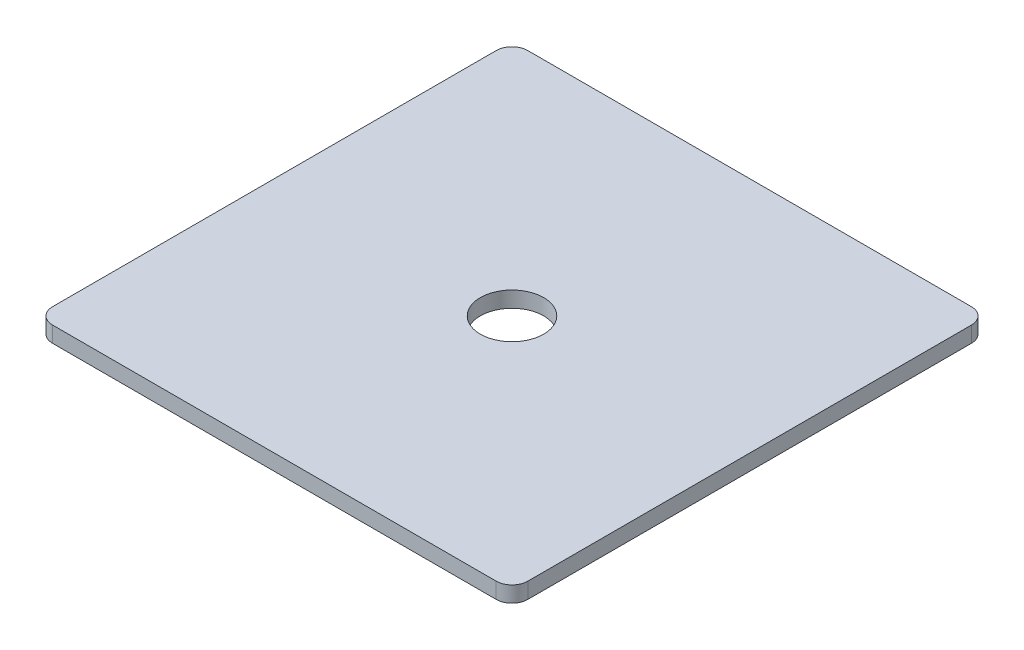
ISO-10303-21;
HEADER;
FILE_DESCRIPTION(('STEP AP214'),'2;1');
FILE_NAME('part.step','',(''),(''),'','','');
FILE_SCHEMA(('AUTOMOTIVE_DESIGN { 1 0 10303 214 1 1 1 1 }'));
ENDSEC;
DATA;
#1=APPLICATION_CONTEXT('core data for automotive mechanical design processes');
#2=APPLICATION_PROTOCOL_DEFINITION('international standard','automotive_design',2000,#1);
#3=PRODUCT_CONTEXT('',#1,'mechanical');
#4=PRODUCT('Part','Part','',(#3));
#5=PRODUCT_RELATED_PRODUCT_CATEGORY('part','',(#4));
#6=PRODUCT_DEFINITION_FORMATION('','',#4);
#7=PRODUCT_DEFINITION_CONTEXT('part definition',#1,'design');
#8=PRODUCT_DEFINITION('design','',#6,#7);
#9=PRODUCT_DEFINITION_SHAPE('','',#8);
#10=(LENGTH_UNIT() NAMED_UNIT(*) SI_UNIT(.MILLI.,.METRE.));
#11=(NAMED_UNIT(*) PLANE_ANGLE_UNIT() SI_UNIT($,.RADIAN.));
#12=(NAMED_UNIT(*) SI_UNIT($,.STERADIAN.) SOLID_ANGLE_UNIT());
#13=UNCERTAINTY_MEASURE_WITH_UNIT(LENGTH_MEASURE(1.E-05),#10,'distance_accuracy_value','');
#14=(GEOMETRIC_REPRESENTATION_CONTEXT(3) GLOBAL_UNCERTAINTY_ASSIGNED_CONTEXT((#13)) GLOBAL_UNIT_ASSIGNED_CONTEXT((#10,
#11,#12)) REPRESENTATION_CONTEXT('',''));
#15=CARTESIAN_POINT('',(0.,0.,0.));
#16=DIRECTION('',(0.,0.,1.));
#17=DIRECTION('',(1.,0.,0.));
#18=AXIS2_PLACEMENT_3D('',#15,#16,#17);
#19=CARTESIAN_POINT('',(-56.,4.,56.));
#20=DIRECTION('',(0.,1.,0.));
#21=DIRECTION('',(0.,0.,1.));
#22=AXIS2_PLACEMENT_3D('',#19,#20,#21);
#23=PLANE('',#22);
#24=CARTESIAN_POINT('',(-56.,4.,56.));
#25=DIRECTION('',(0.,1.,0.));
#26=DIRECTION('',(0.,0.,1.));
#27=AXIS2_PLACEMENT_3D('',#24,#25,#26);
#28=CIRCLE('',#27,4.);
#29=CARTESIAN_POINT('',(-60.,4.,56.));
#30=VERTEX_POINT('',#29);
#31=CARTESIAN_POINT('',(-56.,4.,60.));
#32=VERTEX_POINT('',#31);
#33=EDGE_CURVE('E145',#30,#32,#28,.T.);
#34=ORIENTED_EDGE('',*,*,#33,.T.);
#35=DIRECTION('',(1.,0.,0.));
#36=VECTOR('',#35,1.);
#37=CARTESIAN_POINT('',(-56.,4.,60.));
#38=LINE('',#37,#36);
#39=CARTESIAN_POINT('',(56.,4.,60.));
#40=VERTEX_POINT('',#39);
#41=EDGE_CURVE('E93',#32,#40,#38,.T.);
#42=ORIENTED_EDGE('',*,*,#41,.T.);
#43=CARTESIAN_POINT('',(56.,4.,56.));
#44=DIRECTION('',(0.,1.,0.));
#45=DIRECTION('',(0.,0.,1.));
#46=AXIS2_PLACEMENT_3D('',#43,#44,#45);
#47=CIRCLE('',#46,4.);
#48=CARTESIAN_POINT('',(60.,4.,56.));
#49=VERTEX_POINT('',#48);
#50=EDGE_CURVE('E160',#40,#49,#47,.T.);
#51=ORIENTED_EDGE('',*,*,#50,.T.);
#52=DIRECTION('',(0.,0.,-1.));
#53=VECTOR('',#52,1.);
#54=CARTESIAN_POINT('',(60.,4.,-56.));
#55=LINE('',#54,#53);
#56=CARTESIAN_POINT('',(60.,4.,-56.));
#57=VERTEX_POINT('',#56);
#58=EDGE_CURVE('E173',#49,#57,#55,.T.);
#59=ORIENTED_EDGE('',*,*,#58,.T.);
#60=CARTESIAN_POINT('',(56.,4.,-56.));
#61=DIRECTION('',(0.,1.,0.));
#62=DIRECTION('',(0.,0.,1.));
#63=AXIS2_PLACEMENT_3D('',#60,#61,#62);
#64=CIRCLE('',#63,4.);
#65=CARTESIAN_POINT('',(56.,4.,-60.));
#66=VERTEX_POINT('',#65);
#67=EDGE_CURVE('E112',#57,#66,#64,.T.);
#68=ORIENTED_EDGE('',*,*,#67,.T.);
#69=DIRECTION('',(-1.,0.,0.));
#70=VECTOR('',#69,1.);
#71=CARTESIAN_POINT('',(-56.,4.,-60.));
#72=LINE('',#71,#70);
#73=CARTESIAN_POINT('',(-56.,4.,-60.));
#74=VERTEX_POINT('',#73);
#75=EDGE_CURVE('E106',#66,#74,#72,.T.);
#76=ORIENTED_EDGE('',*,*,#75,.T.);
#77=CARTESIAN_POINT('',(-56.,4.,-56.));
#78=DIRECTION('',(0.,1.,0.));
#79=DIRECTION('',(0.,0.,1.));
#80=AXIS2_PLACEMENT_3D('',#77,#78,#79);
#81=CIRCLE('',#80,4.);
#82=CARTESIAN_POINT('',(-60.,4.,-56.));
#83=VERTEX_POINT('',#82);
#84=EDGE_CURVE('E110',#74,#83,#81,.T.);
#85=ORIENTED_EDGE('',*,*,#84,.T.);
#86=DIRECTION('',(0.,0.,1.));
#87=VECTOR('',#86,1.);
#88=CARTESIAN_POINT('',(-60.,4.,-56.));
#89=LINE('',#88,#87);
#90=EDGE_CURVE('E50',#83,#30,#89,.T.);
#91=ORIENTED_EDGE('',*,*,#90,.T.);
#92=EDGE_LOOP('',(#34,#42,#51,#59,#68,#76,#85,#91));
#93=FACE_BOUND('',#92,.T.);
#94=CARTESIAN_POINT('',(0.,4.,0.));
#95=DIRECTION('',(0.,1.,0.));
#96=DIRECTION('',(0.,0.,1.));
#97=AXIS2_PLACEMENT_3D('',#94,#95,#96);
#98=CIRCLE('',#97,8.);
#99=CARTESIAN_POINT('',(0.,4.,8.));
#100=VERTEX_POINT('',#99);
#101=EDGE_CURVE('E134',#100,#100,#98,.T.);
#102=ORIENTED_EDGE('',*,*,#101,.F.);
#103=EDGE_LOOP('',(#102));
#104=FACE_BOUND('',#103,.T.);
#105=ADVANCED_FACE('F33',(#93,#104),#23,.T.);
#106=CARTESIAN_POINT('',(-56.,0.,56.));
#107=DIRECTION('',(0.,1.,0.));
#108=DIRECTION('',(0.,0.,1.));
#109=AXIS2_PLACEMENT_3D('',#106,#107,#108);
#110=PLANE('',#109);
#111=CARTESIAN_POINT('',(-56.,0.,56.));
#112=DIRECTION('',(0.,1.,0.));
#113=DIRECTION('',(0.,0.,1.));
#114=AXIS2_PLACEMENT_3D('',#111,#112,#113);
#115=CIRCLE('',#114,4.);
#116=CARTESIAN_POINT('',(-60.,0.,56.));
#117=VERTEX_POINT('',#116);
#118=CARTESIAN_POINT('',(-56.,0.,60.));
#119=VERTEX_POINT('',#118);
#120=EDGE_CURVE('E130',#117,#119,#115,.T.);
#121=ORIENTED_EDGE('',*,*,#120,.F.);
#122=DIRECTION('',(0.,0.,1.));
#123=VECTOR('',#122,1.);
#124=CARTESIAN_POINT('',(-60.,0.,-56.));
#125=LINE('',#124,#123);
#126=CARTESIAN_POINT('',(-60.,0.,-56.));
#127=VERTEX_POINT('',#126);
#128=EDGE_CURVE('E85',#127,#117,#125,.T.);
#129=ORIENTED_EDGE('',*,*,#128,.F.);
#130=CARTESIAN_POINT('',(-56.,0.,-56.));
#131=DIRECTION('',(0.,1.,0.));
#132=DIRECTION('',(0.,0.,1.));
#133=AXIS2_PLACEMENT_3D('',#130,#131,#132);
#134=CIRCLE('',#133,4.);
#135=CARTESIAN_POINT('',(-56.,0.,-60.));
#136=VERTEX_POINT('',#135);
#137=EDGE_CURVE('E79',#136,#127,#134,.T.);
#138=ORIENTED_EDGE('',*,*,#137,.F.);
#139=DIRECTION('',(-1.,0.,0.));
#140=VECTOR('',#139,1.);
#141=CARTESIAN_POINT('',(-56.,0.,-60.));
#142=LINE('',#141,#140);
#143=CARTESIAN_POINT('',(56.,0.,-60.));
#144=VERTEX_POINT('',#143);
#145=EDGE_CURVE('E120',#144,#136,#142,.T.);
#146=ORIENTED_EDGE('',*,*,#145,.F.);
#147=CARTESIAN_POINT('',(56.,0.,-56.));
#148=DIRECTION('',(0.,1.,0.));
#149=DIRECTION('',(0.,0.,1.));
#150=AXIS2_PLACEMENT_3D('',#147,#148,#149);
#151=CIRCLE('',#150,4.);
#152=CARTESIAN_POINT('',(60.,0.,-56.));
#153=VERTEX_POINT('',#152);
#154=EDGE_CURVE('E140',#153,#144,#151,.T.);
#155=ORIENTED_EDGE('',*,*,#154,.F.);
#156=DIRECTION('',(0.,0.,-1.));
#157=VECTOR('',#156,1.);
#158=CARTESIAN_POINT('',(60.,0.,-56.));
#159=LINE('',#158,#157);
#160=CARTESIAN_POINT('',(60.,0.,56.));
#161=VERTEX_POINT('',#160);
#162=EDGE_CURVE('E138',#161,#153,#159,.T.);
#163=ORIENTED_EDGE('',*,*,#162,.F.);
#164=CARTESIAN_POINT('',(56.,0.,56.));
#165=DIRECTION('',(0.,1.,0.));
#166=DIRECTION('',(0.,0.,1.));
#167=AXIS2_PLACEMENT_3D('',#164,#165,#166);
#168=CIRCLE('',#167,4.);
#169=CARTESIAN_POINT('',(56.,0.,60.));
#170=VERTEX_POINT('',#169);
#171=EDGE_CURVE('E136',#170,#161,#168,.T.);
#172=ORIENTED_EDGE('',*,*,#171,.F.);
#173=DIRECTION('',(1.,0.,0.));
#174=VECTOR('',#173,1.);
#175=CARTESIAN_POINT('',(-56.,0.,60.));
#176=LINE('',#175,#174);
#177=EDGE_CURVE('E133',#119,#170,#176,.T.);
#178=ORIENTED_EDGE('',*,*,#177,.F.);
#179=EDGE_LOOP('',(#121,#129,#138,#146,#155,#163,#172,#178));
#180=FACE_BOUND('',#179,.T.);
#181=CARTESIAN_POINT('',(0.,0.,0.));
#182=DIRECTION('',(0.,1.,0.));
#183=DIRECTION('',(0.,0.,1.));
#184=AXIS2_PLACEMENT_3D('',#181,#182,#183);
#185=CIRCLE('',#184,8.);
#186=CARTESIAN_POINT('',(0.,0.,8.));
#187=VERTEX_POINT('',#186);
#188=EDGE_CURVE('E179',#187,#187,#185,.T.);
#189=ORIENTED_EDGE('',*,*,#188,.T.);
#190=EDGE_LOOP('',(#189));
#191=FACE_BOUND('',#190,.T.);
#192=ADVANCED_FACE('F164',(#180,#191),#110,.F.);
#193=CARTESIAN_POINT('',(-56.,4.,56.));
#194=DIRECTION('',(0.,-1.,0.));
#195=DIRECTION('',(0.,0.,-1.));
#196=AXIS2_PLACEMENT_3D('',#193,#194,#195);
#197=CYLINDRICAL_SURFACE('',#196,4.);
#198=ORIENTED_EDGE('',*,*,#120,.T.);
#199=DIRECTION('',(0.,-1.,0.));
#200=VECTOR('',#199,1.);
#201=CARTESIAN_POINT('',(-56.,4.,60.));
#202=LINE('',#201,#200);
#203=EDGE_CURVE('E11',#32,#119,#202,.T.);
#204=ORIENTED_EDGE('',*,*,#203,.F.);
#205=ORIENTED_EDGE('',*,*,#33,.F.);
#206=DIRECTION('',(0.,-1.,0.));
#207=VECTOR('',#206,1.);
#208=CARTESIAN_POINT('',(-60.,4.,56.));
#209=LINE('',#208,#207);
#210=EDGE_CURVE('E126',#30,#117,#209,.T.);
#211=ORIENTED_EDGE('',*,*,#210,.T.);
#212=EDGE_LOOP('',(#198,#204,#205,#211));
#213=FACE_BOUND('',#212,.T.);
#214=ADVANCED_FACE('F35',(#213),#197,.T.);
#215=CARTESIAN_POINT('',(-56.,4.,60.));
#216=DIRECTION('',(0.,0.,-1.));
#217=DIRECTION('',(-1.,0.,0.));
#218=AXIS2_PLACEMENT_3D('',#215,#216,#217);
#219=PLANE('',#218);
#220=ORIENTED_EDGE('',*,*,#177,.T.);
#221=DIRECTION('',(0.,-1.,0.));
#222=VECTOR('',#221,1.);
#223=CARTESIAN_POINT('',(56.,4.,60.));
#224=LINE('',#223,#222);
#225=EDGE_CURVE('E42',#40,#170,#224,.T.);
#226=ORIENTED_EDGE('',*,*,#225,.F.);
#227=ORIENTED_EDGE('',*,*,#41,.F.);
#228=ORIENTED_EDGE('',*,*,#203,.T.);
#229=EDGE_LOOP('',(#220,#226,#227,#228));
#230=FACE_BOUND('',#229,.T.);
#231=ADVANCED_FACE('F207',(#230),#219,.F.);
#232=CARTESIAN_POINT('',(56.,4.,56.));
#233=DIRECTION('',(0.,-1.,0.));
#234=DIRECTION('',(0.,0.,-1.));
#235=AXIS2_PLACEMENT_3D('',#232,#233,#234);
#236=CYLINDRICAL_SURFACE('',#235,4.);
#237=ORIENTED_EDGE('',*,*,#171,.T.);
#238=DIRECTION('',(0.,-1.,0.));
#239=VECTOR('',#238,1.);
#240=CARTESIAN_POINT('',(60.,4.,56.));
#241=LINE('',#240,#239);
#242=EDGE_CURVE('E152',#49,#161,#241,.T.);
#243=ORIENTED_EDGE('',*,*,#242,.F.);
#244=ORIENTED_EDGE('',*,*,#50,.F.);
#245=ORIENTED_EDGE('',*,*,#225,.T.);
#246=EDGE_LOOP('',(#237,#243,#244,#245));
#247=FACE_BOUND('',#246,.T.);
#248=ADVANCED_FACE('F158',(#247),#236,.T.);
#249=CARTESIAN_POINT('',(60.,4.,-56.));
#250=DIRECTION('',(-1.,0.,0.));
#251=DIRECTION('',(0.,0.,1.));
#252=AXIS2_PLACEMENT_3D('',#249,#250,#251);
#253=PLANE('',#252);
#254=ORIENTED_EDGE('',*,*,#162,.T.);
#255=DIRECTION('',(0.,-1.,0.));
#256=VECTOR('',#255,1.);
#257=CARTESIAN_POINT('',(60.,4.,-56.));
#258=LINE('',#257,#256);
#259=EDGE_CURVE('E149',#57,#153,#258,.T.);
#260=ORIENTED_EDGE('',*,*,#259,.F.);
#261=ORIENTED_EDGE('',*,*,#58,.F.);
#262=ORIENTED_EDGE('',*,*,#242,.T.);
#263=EDGE_LOOP('',(#254,#260,#261,#262));
#264=FACE_BOUND('',#263,.T.);
#265=ADVANCED_FACE('F169',(#264),#253,.F.);
#266=CARTESIAN_POINT('',(56.,4.,-56.));
#267=DIRECTION('',(0.,-1.,0.));
#268=DIRECTION('',(0.,0.,-1.));
#269=AXIS2_PLACEMENT_3D('',#266,#267,#268);
#270=CYLINDRICAL_SURFACE('',#269,4.);
#271=ORIENTED_EDGE('',*,*,#154,.T.);
#272=DIRECTION('',(0.,-1.,0.));
#273=VECTOR('',#272,1.);
#274=CARTESIAN_POINT('',(56.,4.,-60.));
#275=LINE('',#274,#273);
#276=EDGE_CURVE('E121',#66,#144,#275,.T.);
#277=ORIENTED_EDGE('',*,*,#276,.F.);
#278=ORIENTED_EDGE('',*,*,#67,.F.);
#279=ORIENTED_EDGE('',*,*,#259,.T.);
#280=EDGE_LOOP('',(#271,#277,#278,#279));
#281=FACE_BOUND('',#280,.T.);
#282=ADVANCED_FACE('F172',(#281),#270,.T.);
#283=CARTESIAN_POINT('',(-56.,4.,-60.));
#284=DIRECTION('',(0.,0.,1.));
#285=DIRECTION('',(1.,0.,0.));
#286=AXIS2_PLACEMENT_3D('',#283,#284,#285);
#287=PLANE('',#286);
#288=ORIENTED_EDGE('',*,*,#145,.T.);
#289=DIRECTION('',(0.,-1.,0.));
#290=VECTOR('',#289,1.);
#291=CARTESIAN_POINT('',(-56.,4.,-60.));
#292=LINE('',#291,#290);
#293=EDGE_CURVE('E117',#74,#136,#292,.T.);
#294=ORIENTED_EDGE('',*,*,#293,.F.);
#295=ORIENTED_EDGE('',*,*,#75,.F.);
#296=ORIENTED_EDGE('',*,*,#276,.T.);
#297=EDGE_LOOP('',(#288,#294,#295,#296));
#298=FACE_BOUND('',#297,.T.);
#299=ADVANCED_FACE('F118',(#298),#287,.F.);
#300=CARTESIAN_POINT('',(-56.,4.,-56.));
#301=DIRECTION('',(0.,-1.,0.));
#302=DIRECTION('',(0.,0.,-1.));
#303=AXIS2_PLACEMENT_3D('',#300,#301,#302);
#304=CYLINDRICAL_SURFACE('',#303,4.);
#305=ORIENTED_EDGE('',*,*,#137,.T.);
#306=DIRECTION('',(0.,-1.,0.));
#307=VECTOR('',#306,1.);
#308=CARTESIAN_POINT('',(-60.,4.,-56.));
#309=LINE('',#308,#307);
#310=EDGE_CURVE('E122',#83,#127,#309,.T.);
#311=ORIENTED_EDGE('',*,*,#310,.F.);
#312=ORIENTED_EDGE('',*,*,#84,.F.);
#313=ORIENTED_EDGE('',*,*,#293,.T.);
#314=EDGE_LOOP('',(#305,#311,#312,#313));
#315=FACE_BOUND('',#314,.T.);
#316=ADVANCED_FACE('F124',(#315),#304,.T.);
#317=CARTESIAN_POINT('',(-60.,4.,-56.));
#318=DIRECTION('',(1.,0.,0.));
#319=DIRECTION('',(0.,0.,-1.));
#320=AXIS2_PLACEMENT_3D('',#317,#318,#319);
#321=PLANE('',#320);
#322=ORIENTED_EDGE('',*,*,#128,.T.);
#323=ORIENTED_EDGE('',*,*,#210,.F.);
#324=ORIENTED_EDGE('',*,*,#90,.F.);
#325=ORIENTED_EDGE('',*,*,#310,.T.);
#326=EDGE_LOOP('',(#322,#323,#324,#325));
#327=FACE_BOUND('',#326,.T.);
#328=ADVANCED_FACE('F195',(#327),#321,.F.);
#329=CARTESIAN_POINT('',(0.,4.,0.));
#330=DIRECTION('',(0.,-1.,0.));
#331=DIRECTION('',(0.,0.,-1.));
#332=AXIS2_PLACEMENT_3D('',#329,#330,#331);
#333=CYLINDRICAL_SURFACE('',#332,8.);
#334=ORIENTED_EDGE('',*,*,#101,.T.);
#335=EDGE_LOOP('',(#334));
#336=FACE_BOUND('',#335,.T.);
#337=ORIENTED_EDGE('',*,*,#188,.F.);
#338=EDGE_LOOP('',(#337));
#339=FACE_BOUND('',#338,.T.);
#340=ADVANCED_FACE('F185',(#336,#339),#333,.F.);
#341=CLOSED_SHELL('',(#105,#192,#214,#231,#248,#265,#282,#299,#316,#328,#340));
#342=MANIFOLD_SOLID_BREP('B2',#341);
#343=ADVANCED_BREP_SHAPE_REPRESENTATION('',(#18,#342),#14);
#344=SHAPE_DEFINITION_REPRESENTATION(#9,#343);
ENDSEC;
END-ISO-10303-21;
